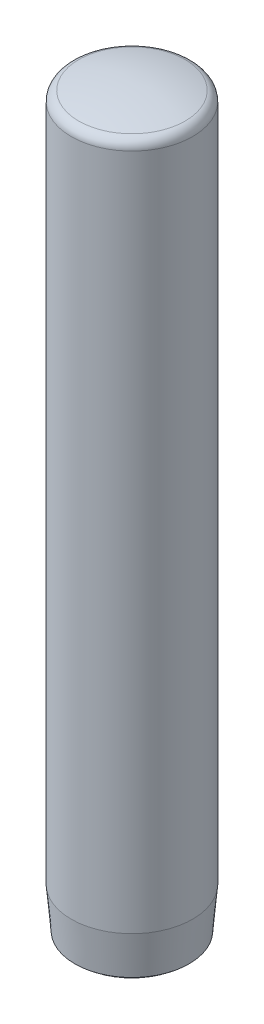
ISO-10303-21;
HEADER;
FILE_DESCRIPTION(('STEP AP214'),'2;1');
FILE_NAME('part.step','',(''),(''),'','','');
FILE_SCHEMA(('AUTOMOTIVE_DESIGN { 1 0 10303 214 1 1 1 1 }'));
ENDSEC;
DATA;
#1=APPLICATION_CONTEXT('core data for automotive mechanical design processes');
#2=APPLICATION_PROTOCOL_DEFINITION('international standard','automotive_design',2000,#1);
#3=PRODUCT_CONTEXT('',#1,'mechanical');
#4=PRODUCT('Part','Part','',(#3));
#5=PRODUCT_RELATED_PRODUCT_CATEGORY('part','',(#4));
#6=PRODUCT_DEFINITION_FORMATION('','',#4);
#7=PRODUCT_DEFINITION_CONTEXT('part definition',#1,'design');
#8=PRODUCT_DEFINITION('design','',#6,#7);
#9=PRODUCT_DEFINITION_SHAPE('','',#8);
#10=(LENGTH_UNIT() NAMED_UNIT(*) SI_UNIT(.MILLI.,.METRE.));
#11=(NAMED_UNIT(*) PLANE_ANGLE_UNIT() SI_UNIT($,.RADIAN.));
#12=(NAMED_UNIT(*) SI_UNIT($,.STERADIAN.) SOLID_ANGLE_UNIT());
#13=UNCERTAINTY_MEASURE_WITH_UNIT(LENGTH_MEASURE(1.E-05),#10,'distance_accuracy_value','');
#14=(GEOMETRIC_REPRESENTATION_CONTEXT(3) GLOBAL_UNCERTAINTY_ASSIGNED_CONTEXT((#13)) GLOBAL_UNIT_ASSIGNED_CONTEXT((#10,
#11,#12)) REPRESENTATION_CONTEXT('',''));
#15=CARTESIAN_POINT('',(0.,0.,0.));
#16=DIRECTION('',(0.,0.,1.));
#17=DIRECTION('',(1.,0.,0.));
#18=AXIS2_PLACEMENT_3D('',#15,#16,#17);
#19=CARTESIAN_POINT('',(0.,4.17854286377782,0.110360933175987));
#20=DIRECTION('',(-1.,0.,0.));
#21=DIRECTION('',(0.,0.,1.));
#22=AXIS2_PLACEMENT_3D('',#19,#20,#21);
#23=CIRCLE('',#22,4.18);
#24=TRIMMED_CURVE('',#23,(PARAMETER_VALUE(-1.59720153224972)),
(PARAMETER_VALUE(1.59720153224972)),.T.,.PARAMETER.);
#25=CARTESIAN_POINT('',(0.,4.17854286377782,0.));
#26=DIRECTION('',(0.,1.,0.));
#27=AXIS1_PLACEMENT('',#25,#26);
#28=SURFACE_OF_REVOLUTION('',#24,#27);
#29=CARTESIAN_POINT('',(0.,0.,0.));
#30=VERTEX_POINT('',#29);
#31=VERTEX_LOOP('',#30);
#32=FACE_BOUND('',#31,.T.);
#33=CARTESIAN_POINT('',(0.,1.,0.));
#34=DIRECTION('',(0.,1.,0.));
#35=DIRECTION('',(0.,0.,1.));
#36=AXIS2_PLACEMENT_3D('',#33,#34,#35);
#37=CIRCLE('',#36,2.82499999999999);
#38=CARTESIAN_POINT('',(0.,1.,2.82499999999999));
#39=VERTEX_POINT('',#38);
#40=EDGE_CURVE('E11',#39,#39,#37,.T.);
#41=ORIENTED_EDGE('',*,*,#40,.F.);
#42=EDGE_LOOP('',(#41));
#43=FACE_BOUND('',#42,.T.);
#44=ADVANCED_FACE('F29',(#32,#43),#28,.T.);
#45=CARTESIAN_POINT('',(0.,3.,0.));
#46=DIRECTION('',(0.,1.,0.));
#47=DIRECTION('',(0.,0.,1.));
#48=AXIS2_PLACEMENT_3D('',#45,#46,#47);
#49=CONICAL_SURFACE('',#48,3.,0.0872777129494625);
#50=ORIENTED_EDGE('',*,*,#40,.T.);
#51=EDGE_LOOP('',(#50));
#52=FACE_BOUND('',#51,.T.);
#53=CARTESIAN_POINT('',(0.,3.,0.));
#54=DIRECTION('',(0.,1.,0.));
#55=DIRECTION('',(0.,0.,1.));
#56=AXIS2_PLACEMENT_3D('',#53,#54,#55);
#57=CIRCLE('',#56,3.);
#58=CARTESIAN_POINT('',(0.,3.,3.));
#59=VERTEX_POINT('',#58);
#60=EDGE_CURVE('E35',#59,#59,#57,.T.);
#61=ORIENTED_EDGE('',*,*,#60,.F.);
#62=EDGE_LOOP('',(#61));
#63=FACE_BOUND('',#62,.T.);
#64=ADVANCED_FACE('F40',(#52,#63),#49,.T.);
#65=CARTESIAN_POINT('',(0.,27.3348486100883,0.));
#66=DIRECTION('',(0.,1.,0.));
#67=DIRECTION('',(0.,0.,1.));
#68=AXIS2_PLACEMENT_3D('',#65,#66,#67);
#69=CYLINDRICAL_SURFACE('',#68,3.);
#70=ORIENTED_EDGE('',*,*,#60,.T.);
#71=EDGE_LOOP('',(#70));
#72=FACE_BOUND('',#71,.T.);
#73=CARTESIAN_POINT('',(0.,36.5,0.));
#74=DIRECTION('',(0.,1.,0.));
#75=DIRECTION('',(0.,0.,1.));
#76=AXIS2_PLACEMENT_3D('',#73,#74,#75);
#77=CIRCLE('',#76,3.);
#78=CARTESIAN_POINT('',(0.,36.5,3.));
#79=VERTEX_POINT('',#78);
#80=EDGE_CURVE('E49',#79,#79,#77,.T.);
#81=ORIENTED_EDGE('',*,*,#80,.F.);
#82=EDGE_LOOP('',(#81));
#83=FACE_BOUND('',#82,.T.);
#84=ADVANCED_FACE('F45',(#72,#83),#69,.T.);
#85=CARTESIAN_POINT('',(0.,36.5,0.));
#86=DIRECTION('',(0.,1.,0.));
#87=DIRECTION('',(0.,0.,1.));
#88=AXIS2_PLACEMENT_3D('',#85,#86,#87);
#89=TOROIDAL_SURFACE('',#88,2.5,0.499999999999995);
#90=ORIENTED_EDGE('',*,*,#80,.T.);
#91=EDGE_LOOP('',(#90));
#92=FACE_BOUND('',#91,.T.);
#93=CARTESIAN_POINT('',(0.,36.9823763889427,0.));
#94=DIRECTION('',(0.,1.,0.));
#95=DIRECTION('',(0.,0.,1.));
#96=AXIS2_PLACEMENT_3D('',#93,#94,#95);
#97=CIRCLE('',#96,2.63157894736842);
#98=CARTESIAN_POINT('',(0.,36.9823763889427,2.63157894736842));
#99=VERTEX_POINT('',#98);
#100=EDGE_CURVE('E51',#99,#99,#97,.T.);
#101=ORIENTED_EDGE('',*,*,#100,.F.);
#102=EDGE_LOOP('',(#101));
#103=FACE_BOUND('',#102,.T.);
#104=ADVANCED_FACE('F59',(#92,#103),#89,.T.);
#105=CARTESIAN_POINT('',(0.,27.3348486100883,0.));
#106=DIRECTION('',(0.,1.,0.));
#107=DIRECTION('',(1.,0.,0.));
#108=AXIS2_PLACEMENT_3D('',#105,#106,#107);
#109=SPHERICAL_SURFACE('',#108,10.);
#110=ORIENTED_EDGE('',*,*,#100,.T.);
#111=EDGE_LOOP('',(#110));
#112=FACE_BOUND('',#111,.T.);
#113=ADVANCED_FACE('F57',(#112),#109,.T.);
#114=CLOSED_SHELL('',(#44,#64,#84,#104,#113));
#115=MANIFOLD_SOLID_BREP('B2',#114);
#116=ADVANCED_BREP_SHAPE_REPRESENTATION('',(#18,#115),#14);
#117=SHAPE_DEFINITION_REPRESENTATION(#9,#116);
ENDSEC;
END-ISO-10303-21;
